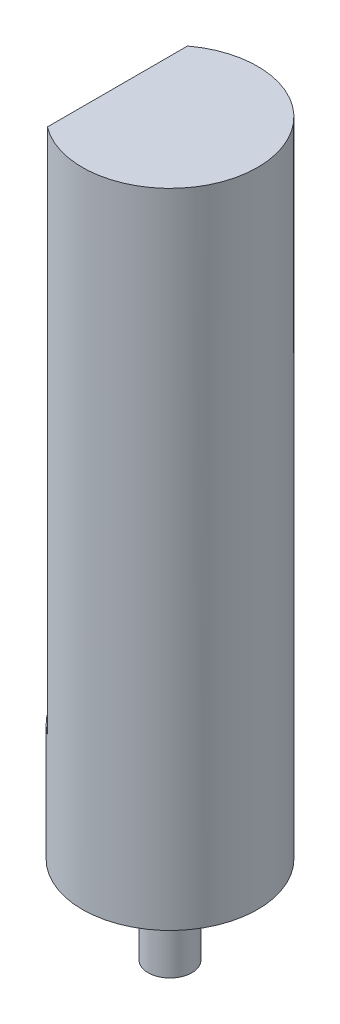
ISO-10303-21;
HEADER;
FILE_DESCRIPTION(('STEP AP214'),'2;1');
FILE_NAME('part.step','',(''),(''),'','','');
FILE_SCHEMA(('AUTOMOTIVE_DESIGN { 1 0 10303 214 1 1 1 1 }'));
ENDSEC;
DATA;
#1=APPLICATION_CONTEXT('core data for automotive mechanical design processes');
#2=APPLICATION_PROTOCOL_DEFINITION('international standard','automotive_design',2000,#1);
#3=PRODUCT_CONTEXT('',#1,'mechanical');
#4=PRODUCT('Part','Part','',(#3));
#5=PRODUCT_RELATED_PRODUCT_CATEGORY('part','',(#4));
#6=PRODUCT_DEFINITION_FORMATION('','',#4);
#7=PRODUCT_DEFINITION_CONTEXT('part definition',#1,'design');
#8=PRODUCT_DEFINITION('design','',#6,#7);
#9=PRODUCT_DEFINITION_SHAPE('','',#8);
#10=(LENGTH_UNIT() NAMED_UNIT(*) SI_UNIT(.MILLI.,.METRE.));
#11=(NAMED_UNIT(*) PLANE_ANGLE_UNIT() SI_UNIT($,.RADIAN.));
#12=(NAMED_UNIT(*) SI_UNIT($,.STERADIAN.) SOLID_ANGLE_UNIT());
#13=UNCERTAINTY_MEASURE_WITH_UNIT(LENGTH_MEASURE(1.E-05),#10,'distance_accuracy_value','');
#14=(GEOMETRIC_REPRESENTATION_CONTEXT(3) GLOBAL_UNCERTAINTY_ASSIGNED_CONTEXT((#13)) GLOBAL_UNIT_ASSIGNED_CONTEXT((#10,
#11,#12)) REPRESENTATION_CONTEXT('',''));
#15=CARTESIAN_POINT('',(0.,0.,0.));
#16=DIRECTION('',(0.,0.,1.));
#17=DIRECTION('',(1.,0.,0.));
#18=AXIS2_PLACEMENT_3D('',#15,#16,#17);
#19=CARTESIAN_POINT('',(0.,11.,0.));
#20=DIRECTION('',(0.,-1.,0.));
#21=DIRECTION('',(0.,0.,-1.));
#22=AXIS2_PLACEMENT_3D('',#19,#20,#21);
#23=CYLINDRICAL_SURFACE('',#22,1.5);
#24=CARTESIAN_POINT('',(0.,11.,0.));
#25=DIRECTION('',(0.,1.,0.));
#26=DIRECTION('',(0.,0.,1.));
#27=AXIS2_PLACEMENT_3D('',#24,#25,#26);
#28=CIRCLE('',#27,1.5);
#29=CARTESIAN_POINT('',(-0.9,11.,1.2));
#30=VERTEX_POINT('',#29);
#31=CARTESIAN_POINT('',(-0.9,11.,-1.2));
#32=VERTEX_POINT('',#31);
#33=EDGE_CURVE('E43',#30,#32,#28,.T.);
#34=ORIENTED_EDGE('',*,*,#33,.F.);
#35=DIRECTION('',(0.,1.,0.));
#36=VECTOR('',#35,1.);
#37=CARTESIAN_POINT('',(-0.9,2.,1.2));
#38=LINE('',#37,#36);
#39=CARTESIAN_POINT('',(-0.9,2.,1.2));
#40=VERTEX_POINT('',#39);
#41=EDGE_CURVE('E50',#40,#30,#38,.T.);
#42=ORIENTED_EDGE('',*,*,#41,.F.);
#43=CARTESIAN_POINT('',(0.,2.,0.));
#44=DIRECTION('',(0.,1.,0.));
#45=DIRECTION('',(0.,0.,1.));
#46=AXIS2_PLACEMENT_3D('',#43,#44,#45);
#47=CIRCLE('',#46,1.5);
#48=CARTESIAN_POINT('',(-0.9,2.,-1.2));
#49=VERTEX_POINT('',#48);
#50=EDGE_CURVE('E66',#49,#40,#47,.T.);
#51=ORIENTED_EDGE('',*,*,#50,.F.);
#52=DIRECTION('',(0.,1.,0.));
#53=VECTOR('',#52,1.);
#54=CARTESIAN_POINT('',(-0.9,2.,-1.2));
#55=LINE('',#54,#53);
#56=EDGE_CURVE('E56',#49,#32,#55,.T.);
#57=ORIENTED_EDGE('',*,*,#56,.T.);
#58=EDGE_LOOP('',(#34,#42,#51,#57));
#59=FACE_BOUND('',#58,.T.);
#60=CARTESIAN_POINT('',(0.,0.,0.));
#61=DIRECTION('',(0.,1.,0.));
#62=DIRECTION('',(0.,0.,1.));
#63=AXIS2_PLACEMENT_3D('',#60,#61,#62);
#64=CIRCLE('',#63,1.5);
#65=CARTESIAN_POINT('',(0.,0.,1.5));
#66=VERTEX_POINT('',#65);
#67=EDGE_CURVE('E72',#66,#66,#64,.T.);
#68=ORIENTED_EDGE('',*,*,#67,.T.);
#69=EDGE_LOOP('',(#68));
#70=FACE_BOUND('',#69,.T.);
#71=ADVANCED_FACE('F36',(#59,#70),#23,.T.);
#72=CARTESIAN_POINT('',(0.,11.,0.));
#73=DIRECTION('',(0.,1.,0.));
#74=DIRECTION('',(0.,0.,1.));
#75=AXIS2_PLACEMENT_3D('',#72,#73,#74);
#76=PLANE('',#75);
#77=DIRECTION('',(0.,0.,-1.));
#78=VECTOR('',#77,1.);
#79=CARTESIAN_POINT('',(-0.9,11.,1.2));
#80=LINE('',#79,#78);
#81=EDGE_CURVE('E61',#30,#32,#80,.T.);
#82=ORIENTED_EDGE('',*,*,#81,.F.);
#83=ORIENTED_EDGE('',*,*,#33,.T.);
#84=EDGE_LOOP('',(#82,#83));
#85=FACE_BOUND('',#84,.T.);
#86=ADVANCED_FACE('F74',(#85),#76,.T.);
#87=CARTESIAN_POINT('',(0.,0.,0.));
#88=DIRECTION('',(0.,1.,0.));
#89=DIRECTION('',(0.,0.,1.));
#90=AXIS2_PLACEMENT_3D('',#87,#88,#89);
#91=PLANE('',#90);
#92=CARTESIAN_POINT('',(0.,0.,0.));
#93=DIRECTION('',(0.,1.,0.));
#94=DIRECTION('',(0.,0.,1.));
#95=AXIS2_PLACEMENT_3D('',#92,#93,#94);
#96=CIRCLE('',#95,0.375);
#97=CARTESIAN_POINT('',(0.,0.,0.375));
#98=VERTEX_POINT('',#97);
#99=EDGE_CURVE('E11',#98,#98,#96,.F.);
#100=ORIENTED_EDGE('',*,*,#99,.F.);
#101=EDGE_LOOP('',(#100));
#102=FACE_BOUND('',#101,.T.);
#103=ORIENTED_EDGE('',*,*,#67,.F.);
#104=EDGE_LOOP('',(#103));
#105=FACE_BOUND('',#104,.T.);
#106=ADVANCED_FACE('F94',(#102,#105),#91,.F.);
#107=CARTESIAN_POINT('',(-0.9,2.,1.2));
#108=DIRECTION('',(1.,0.,0.));
#109=DIRECTION('',(0.,0.,-1.));
#110=AXIS2_PLACEMENT_3D('',#107,#108,#109);
#111=PLANE('',#110);
#112=ORIENTED_EDGE('',*,*,#81,.T.);
#113=ORIENTED_EDGE('',*,*,#56,.F.);
#114=DIRECTION('',(0.,0.,-1.));
#115=VECTOR('',#114,1.);
#116=CARTESIAN_POINT('',(-0.9,2.,1.2));
#117=LINE('',#116,#115);
#118=EDGE_CURVE('E78',#40,#49,#117,.T.);
#119=ORIENTED_EDGE('',*,*,#118,.F.);
#120=ORIENTED_EDGE('',*,*,#41,.T.);
#121=EDGE_LOOP('',(#112,#113,#119,#120));
#122=FACE_BOUND('',#121,.T.);
#123=ADVANCED_FACE('F62',(#122),#111,.F.);
#124=CARTESIAN_POINT('',(0.,2.,0.));
#125=DIRECTION('',(0.,1.,0.));
#126=DIRECTION('',(0.,0.,1.));
#127=AXIS2_PLACEMENT_3D('',#124,#125,#126);
#128=PLANE('',#127);
#129=ORIENTED_EDGE('',*,*,#50,.T.);
#130=ORIENTED_EDGE('',*,*,#118,.T.);
#131=EDGE_LOOP('',(#129,#130));
#132=FACE_BOUND('',#131,.T.);
#133=ADVANCED_FACE('F90',(#132),#128,.T.);
#134=CARTESIAN_POINT('',(0.,-1.5,0.));
#135=DIRECTION('',(0.,1.,0.));
#136=DIRECTION('',(0.,0.,1.));
#137=AXIS2_PLACEMENT_3D('',#134,#135,#136);
#138=CYLINDRICAL_SURFACE('',#137,0.375);
#139=CARTESIAN_POINT('',(0.,-1.5,0.));
#140=DIRECTION('',(0.,-1.,0.));
#141=DIRECTION('',(0.,0.,-1.));
#142=AXIS2_PLACEMENT_3D('',#139,#140,#141);
#143=CIRCLE('',#142,0.375);
#144=CARTESIAN_POINT('',(0.,-1.5,-0.375));
#145=VERTEX_POINT('',#144);
#146=EDGE_CURVE('E67',#145,#145,#143,.T.);
#147=ORIENTED_EDGE('',*,*,#146,.F.);
#148=EDGE_LOOP('',(#147));
#149=FACE_BOUND('',#148,.T.);
#150=ORIENTED_EDGE('',*,*,#99,.T.);
#151=EDGE_LOOP('',(#150));
#152=FACE_BOUND('',#151,.T.);
#153=ADVANCED_FACE('F87',(#149,#152),#138,.T.);
#154=CARTESIAN_POINT('',(0.,-1.5,0.));
#155=DIRECTION('',(0.,-1.,0.));
#156=DIRECTION('',(0.,0.,-1.));
#157=AXIS2_PLACEMENT_3D('',#154,#155,#156);
#158=PLANE('',#157);
#159=ORIENTED_EDGE('',*,*,#146,.T.);
#160=EDGE_LOOP('',(#159));
#161=FACE_BOUND('',#160,.T.);
#162=ADVANCED_FACE('F85',(#161),#158,.T.);
#163=CLOSED_SHELL('',(#71,#86,#106,#123,#133,#153,#162));
#164=MANIFOLD_SOLID_BREP('B2',#163);
#165=ADVANCED_BREP_SHAPE_REPRESENTATION('',(#18,#164),#14);
#166=SHAPE_DEFINITION_REPRESENTATION(#9,#165);
ENDSEC;
END-ISO-10303-21;
